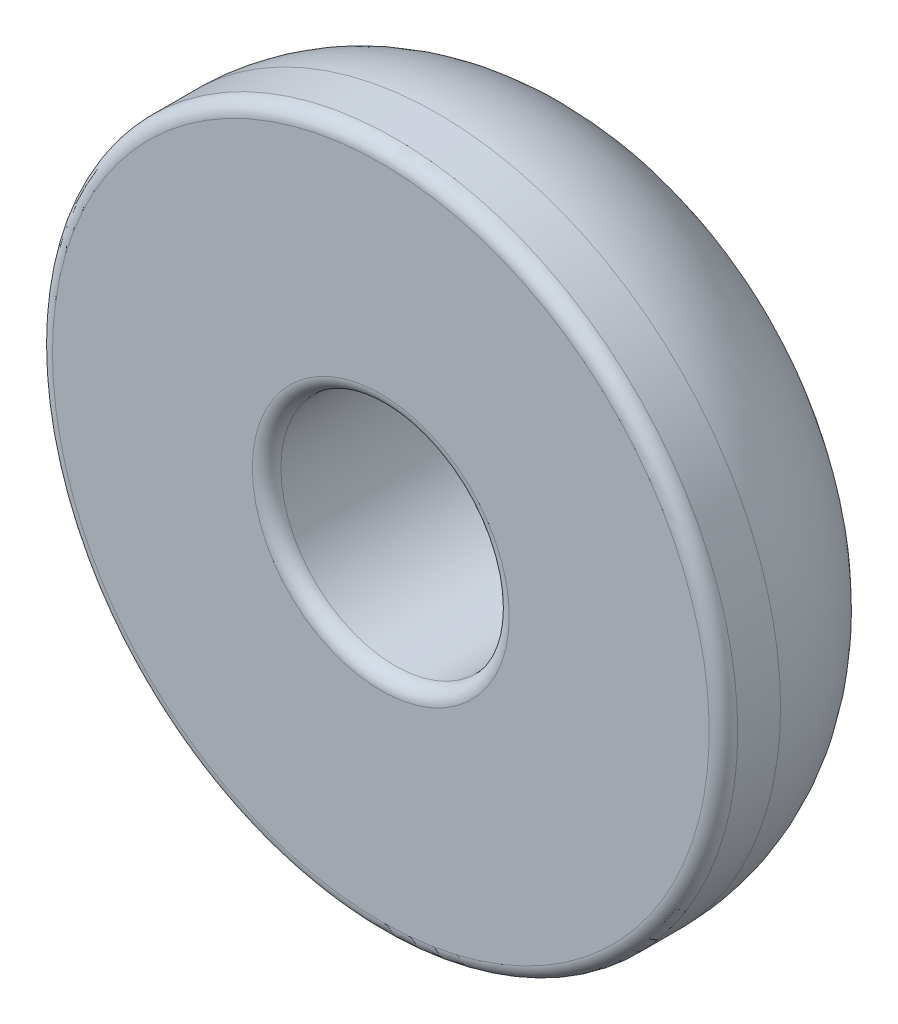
from build123d import *

# Parameters (mm, degrees)
FILLET_1_R = 0.5


with BuildPart() as part:
    # Sketch 1 → Revolve 1 (revolve)
    with BuildSketch(Plane(origin=(0, 0, 0), x_dir=(0, 0, -1), z_dir=(1, 0, 0)), mode=Mode.PRIVATE) as revolve_1_sk:
        with BuildLine():
            Line((4, 4), (-4, 4))
            Line((-4, 4), (-4, 12))
            Line((-4, 12), (-2, 12))
            ThreePointArc((-2, 12), (2.242640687, 10.242640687), (4, 6))
            Line((4, 6), (4, 4))
        make_face()
    revolve(revolve_1_sk.sketch.rotate(Axis((0, 0, 4), (0, 0, -1)), 90), axis=Axis((0, 0, 4), (0, 0, -1)))

    # Fillet 1
    fillet_1_edges = [part.edges().sort_by_distance(p)[0] for p in [
        (-12, 0, 4),
        (-4, 0, 4),
        (-4, 0, -4),
    ]]
    fillet(fillet_1_edges, radius=FILLET_1_R)


solid = part.part
